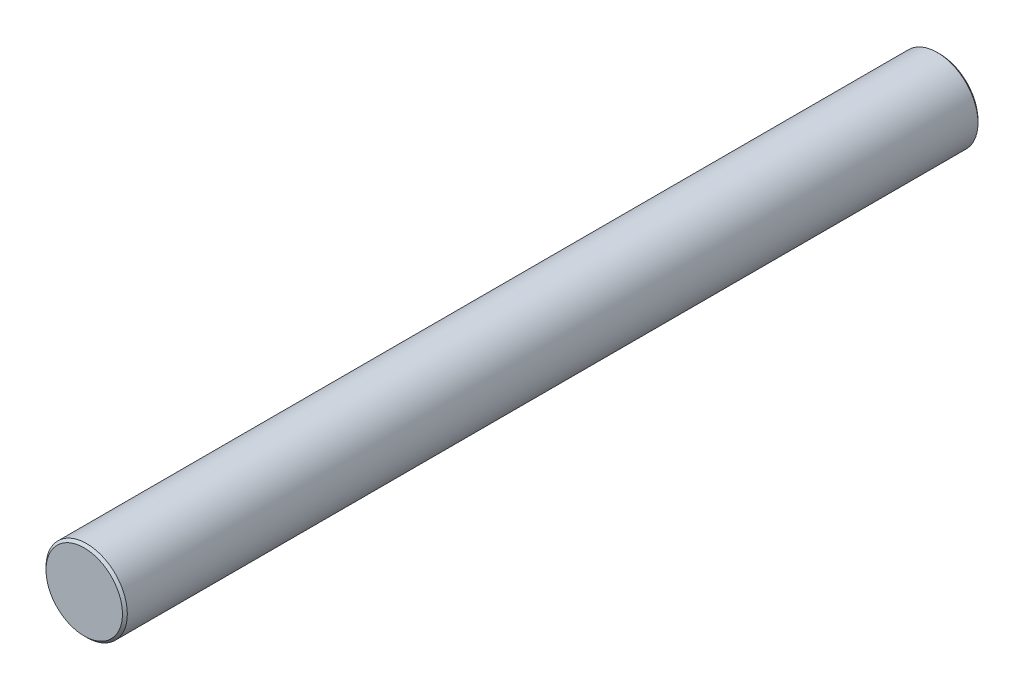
ISO-10303-21;
HEADER;
FILE_DESCRIPTION(('STEP AP214'),'2;1');
FILE_NAME('part.step','',(''),(''),'','','');
FILE_SCHEMA(('AUTOMOTIVE_DESIGN { 1 0 10303 214 1 1 1 1 }'));
ENDSEC;
DATA;
#1=APPLICATION_CONTEXT('core data for automotive mechanical design processes');
#2=APPLICATION_PROTOCOL_DEFINITION('international standard','automotive_design',2000,#1);
#3=PRODUCT_CONTEXT('',#1,'mechanical');
#4=PRODUCT('Part','Part','',(#3));
#5=PRODUCT_RELATED_PRODUCT_CATEGORY('part','',(#4));
#6=PRODUCT_DEFINITION_FORMATION('','',#4);
#7=PRODUCT_DEFINITION_CONTEXT('part definition',#1,'design');
#8=PRODUCT_DEFINITION('design','',#6,#7);
#9=PRODUCT_DEFINITION_SHAPE('','',#8);
#10=(LENGTH_UNIT() NAMED_UNIT(*) SI_UNIT(.MILLI.,.METRE.));
#11=(NAMED_UNIT(*) PLANE_ANGLE_UNIT() SI_UNIT($,.RADIAN.));
#12=(NAMED_UNIT(*) SI_UNIT($,.STERADIAN.) SOLID_ANGLE_UNIT());
#13=UNCERTAINTY_MEASURE_WITH_UNIT(LENGTH_MEASURE(1.E-05),#10,'distance_accuracy_value','');
#14=(GEOMETRIC_REPRESENTATION_CONTEXT(3) GLOBAL_UNCERTAINTY_ASSIGNED_CONTEXT((#13)) GLOBAL_UNIT_ASSIGNED_CONTEXT((#10,
#11,#12)) REPRESENTATION_CONTEXT('',''));
#15=CARTESIAN_POINT('',(0.,0.,0.));
#16=DIRECTION('',(0.,0.,1.));
#17=DIRECTION('',(1.,0.,0.));
#18=AXIS2_PLACEMENT_3D('',#15,#16,#17);
#19=CARTESIAN_POINT('',(0.,0.,0.));
#20=DIRECTION('',(0.,0.,-1.));
#21=DIRECTION('',(-1.,0.,0.));
#22=AXIS2_PLACEMENT_3D('',#19,#20,#21);
#23=PLANE('',#22);
#24=CARTESIAN_POINT('',(0.,0.,0.));
#25=DIRECTION('',(0.,0.,1.));
#26=DIRECTION('',(0.,-1.,0.));
#27=AXIS2_PLACEMENT_3D('',#24,#25,#26);
#28=CIRCLE('',#27,11.75);
#29=CARTESIAN_POINT('',(0.,-11.75,0.));
#30=VERTEX_POINT('',#29);
#31=EDGE_CURVE('E19',#30,#30,#28,.T.);
#32=ORIENTED_EDGE('',*,*,#31,.F.);
#33=EDGE_LOOP('',(#32));
#34=FACE_BOUND('',#33,.T.);
#35=ADVANCED_FACE('F15',(#34),#23,.T.);
#36=CARTESIAN_POINT('',(0.,0.,263.));
#37=DIRECTION('',(0.,0.,-1.));
#38=DIRECTION('',(-1.,0.,0.));
#39=AXIS2_PLACEMENT_3D('',#36,#37,#38);
#40=PLANE('',#39);
#41=CARTESIAN_POINT('',(0.,0.,263.));
#42=DIRECTION('',(0.,0.,-1.));
#43=DIRECTION('',(-1.,0.,0.));
#44=AXIS2_PLACEMENT_3D('',#41,#42,#43);
#45=CIRCLE('',#44,11.75);
#46=CARTESIAN_POINT('',(-11.75,0.,263.));
#47=VERTEX_POINT('',#46);
#48=EDGE_CURVE('E28',#47,#47,#45,.T.);
#49=ORIENTED_EDGE('',*,*,#48,.F.);
#50=EDGE_LOOP('',(#49));
#51=FACE_BOUND('',#50,.T.);
#52=ADVANCED_FACE('F40',(#51),#40,.F.);
#53=CARTESIAN_POINT('',(0.,0.,0.750000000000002));
#54=DIRECTION('',(0.,0.,1.));
#55=DIRECTION('',(0.,-1.,0.));
#56=AXIS2_PLACEMENT_3D('',#53,#54,#55);
#57=CONICAL_SURFACE('',#56,12.5,0.785398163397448);
#58=ORIENTED_EDGE('',*,*,#31,.T.);
#59=EDGE_LOOP('',(#58));
#60=FACE_BOUND('',#59,.T.);
#61=CARTESIAN_POINT('',(0.,0.,0.749999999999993));
#62=DIRECTION('',(0.,0.,1.));
#63=DIRECTION('',(1.,0.,0.));
#64=AXIS2_PLACEMENT_3D('',#61,#62,#63);
#65=CIRCLE('',#64,12.5);
#66=CARTESIAN_POINT('',(12.5,0.,0.749999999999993));
#67=VERTEX_POINT('',#66);
#68=EDGE_CURVE('E23',#67,#67,#65,.T.);
#69=ORIENTED_EDGE('',*,*,#68,.F.);
#70=EDGE_LOOP('',(#69));
#71=FACE_BOUND('',#70,.T.);
#72=ADVANCED_FACE('F36',(#60,#71),#57,.T.);
#73=CARTESIAN_POINT('',(0.,0.,262.25));
#74=DIRECTION('',(0.,0.,-1.));
#75=DIRECTION('',(-1.,0.,0.));
#76=AXIS2_PLACEMENT_3D('',#73,#74,#75);
#77=CONICAL_SURFACE('',#76,12.5,0.785398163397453);
#78=ORIENTED_EDGE('',*,*,#48,.T.);
#79=EDGE_LOOP('',(#78));
#80=FACE_BOUND('',#79,.T.);
#81=CARTESIAN_POINT('',(0.,0.,262.25));
#82=DIRECTION('',(0.,0.,1.));
#83=DIRECTION('',(1.,0.,0.));
#84=AXIS2_PLACEMENT_3D('',#81,#82,#83);
#85=CIRCLE('',#84,12.5);
#86=CARTESIAN_POINT('',(12.5,0.,262.25));
#87=VERTEX_POINT('',#86);
#88=EDGE_CURVE('E10',#87,#87,#85,.F.);
#89=ORIENTED_EDGE('',*,*,#88,.F.);
#90=EDGE_LOOP('',(#89));
#91=FACE_BOUND('',#90,.T.);
#92=ADVANCED_FACE('F49',(#80,#91),#77,.T.);
#93=CARTESIAN_POINT('',(0.,0.,0.));
#94=DIRECTION('',(0.,0.,1.));
#95=DIRECTION('',(1.,0.,0.));
#96=AXIS2_PLACEMENT_3D('',#93,#94,#95);
#97=CYLINDRICAL_SURFACE('',#96,12.5);
#98=ORIENTED_EDGE('',*,*,#68,.T.);
#99=EDGE_LOOP('',(#98));
#100=FACE_BOUND('',#99,.T.);
#101=ORIENTED_EDGE('',*,*,#88,.T.);
#102=EDGE_LOOP('',(#101));
#103=FACE_BOUND('',#102,.T.);
#104=ADVANCED_FACE('F17',(#100,#103),#97,.T.);
#105=CLOSED_SHELL('',(#35,#52,#72,#92,#104));
#106=MANIFOLD_SOLID_BREP('B1',#105);
#107=ADVANCED_BREP_SHAPE_REPRESENTATION('',(#18,#106),#14);
#108=SHAPE_DEFINITION_REPRESENTATION(#9,#107);
ENDSEC;
END-ISO-10303-21;
